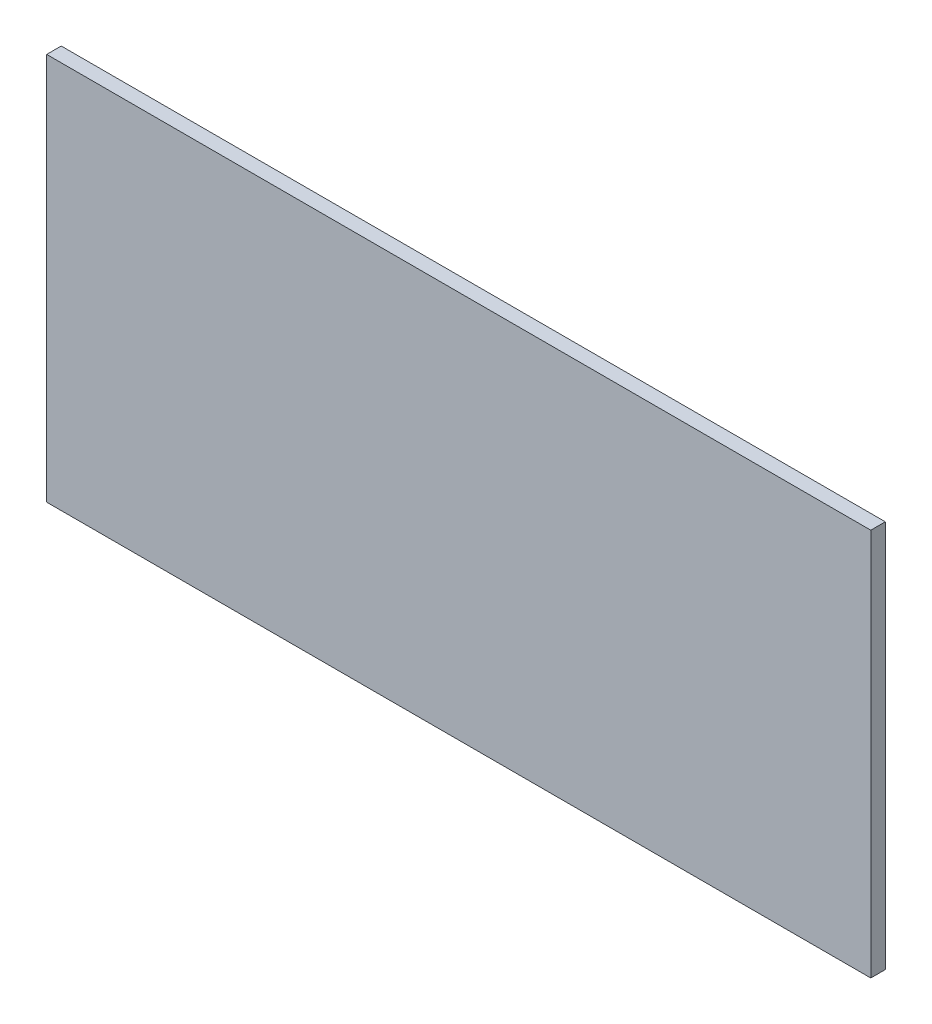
ISO-10303-21;
HEADER;
FILE_DESCRIPTION(('STEP AP214'),'2;1');
FILE_NAME('part.step','',(''),(''),'','','');
FILE_SCHEMA(('AUTOMOTIVE_DESIGN { 1 0 10303 214 1 1 1 1 }'));
ENDSEC;
DATA;
#1=APPLICATION_CONTEXT('core data for automotive mechanical design processes');
#2=APPLICATION_PROTOCOL_DEFINITION('international standard','automotive_design',2000,#1);
#3=PRODUCT_CONTEXT('',#1,'mechanical');
#4=PRODUCT('Part','Part','',(#3));
#5=PRODUCT_RELATED_PRODUCT_CATEGORY('part','',(#4));
#6=PRODUCT_DEFINITION_FORMATION('','',#4);
#7=PRODUCT_DEFINITION_CONTEXT('part definition',#1,'design');
#8=PRODUCT_DEFINITION('design','',#6,#7);
#9=PRODUCT_DEFINITION_SHAPE('','',#8);
#10=(LENGTH_UNIT() NAMED_UNIT(*) SI_UNIT(.MILLI.,.METRE.));
#11=(NAMED_UNIT(*) PLANE_ANGLE_UNIT() SI_UNIT($,.RADIAN.));
#12=(NAMED_UNIT(*) SI_UNIT($,.STERADIAN.) SOLID_ANGLE_UNIT());
#13=UNCERTAINTY_MEASURE_WITH_UNIT(LENGTH_MEASURE(1.E-05),#10,'distance_accuracy_value','');
#14=(GEOMETRIC_REPRESENTATION_CONTEXT(3) GLOBAL_UNCERTAINTY_ASSIGNED_CONTEXT((#13)) GLOBAL_UNIT_ASSIGNED_CONTEXT((#10,
#11,#12)) REPRESENTATION_CONTEXT('',''));
#15=CARTESIAN_POINT('',(0.,0.,0.));
#16=DIRECTION('',(0.,0.,1.));
#17=DIRECTION('',(1.,0.,0.));
#18=AXIS2_PLACEMENT_3D('',#15,#16,#17);
#19=CARTESIAN_POINT('',(0.,0.,30.));
#20=DIRECTION('',(0.,0.,1.));
#21=DIRECTION('',(1.,0.,0.));
#22=AXIS2_PLACEMENT_3D('',#19,#20,#21);
#23=PLANE('',#22);
#24=DIRECTION('',(1.,0.,0.));
#25=VECTOR('',#24,1.);
#26=CARTESIAN_POINT('',(-850.,-400.,30.));
#27=LINE('',#26,#25);
#28=CARTESIAN_POINT('',(-850.,-400.,30.));
#29=VERTEX_POINT('',#28);
#30=CARTESIAN_POINT('',(850.,-400.,30.));
#31=VERTEX_POINT('',#30);
#32=EDGE_CURVE('E81',#29,#31,#27,.T.);
#33=ORIENTED_EDGE('',*,*,#32,.T.);
#34=DIRECTION('',(0.,1.,0.));
#35=VECTOR('',#34,1.);
#36=CARTESIAN_POINT('',(850.,-400.,30.));
#37=LINE('',#36,#35);
#38=CARTESIAN_POINT('',(850.,400.,30.));
#39=VERTEX_POINT('',#38);
#40=EDGE_CURVE('E102',#31,#39,#37,.T.);
#41=ORIENTED_EDGE('',*,*,#40,.T.);
#42=DIRECTION('',(-1.,0.,0.));
#43=VECTOR('',#42,1.);
#44=CARTESIAN_POINT('',(850.,400.,30.));
#45=LINE('',#44,#43);
#46=CARTESIAN_POINT('',(-850.,400.,30.));
#47=VERTEX_POINT('',#46);
#48=EDGE_CURVE('E74',#39,#47,#45,.T.);
#49=ORIENTED_EDGE('',*,*,#48,.T.);
#50=DIRECTION('',(0.,-1.,0.));
#51=VECTOR('',#50,1.);
#52=CARTESIAN_POINT('',(-850.,400.,30.));
#53=LINE('',#52,#51);
#54=EDGE_CURVE('E10',#47,#29,#53,.T.);
#55=ORIENTED_EDGE('',*,*,#54,.T.);
#56=EDGE_LOOP('',(#33,#41,#49,#55));
#57=FACE_BOUND('',#56,.T.);
#58=ADVANCED_FACE('F16',(#57),#23,.T.);
#59=CARTESIAN_POINT('',(0.,0.,0.));
#60=DIRECTION('',(0.,0.,1.));
#61=DIRECTION('',(1.,0.,0.));
#62=AXIS2_PLACEMENT_3D('',#59,#60,#61);
#63=PLANE('',#62);
#64=DIRECTION('',(0.,-1.,0.));
#65=VECTOR('',#64,1.);
#66=CARTESIAN_POINT('',(-850.,400.,0.));
#67=LINE('',#66,#65);
#68=CARTESIAN_POINT('',(-850.,400.,0.));
#69=VERTEX_POINT('',#68);
#70=CARTESIAN_POINT('',(-850.,-400.,0.));
#71=VERTEX_POINT('',#70);
#72=EDGE_CURVE('E25',#69,#71,#67,.T.);
#73=ORIENTED_EDGE('',*,*,#72,.F.);
#74=DIRECTION('',(-1.,0.,0.));
#75=VECTOR('',#74,1.);
#76=CARTESIAN_POINT('',(850.,400.,0.));
#77=LINE('',#76,#75);
#78=CARTESIAN_POINT('',(850.,400.,0.));
#79=VERTEX_POINT('',#78);
#80=EDGE_CURVE('E105',#79,#69,#77,.T.);
#81=ORIENTED_EDGE('',*,*,#80,.F.);
#82=DIRECTION('',(0.,1.,0.));
#83=VECTOR('',#82,1.);
#84=CARTESIAN_POINT('',(850.,-400.,0.));
#85=LINE('',#84,#83);
#86=CARTESIAN_POINT('',(850.,-400.,0.));
#87=VERTEX_POINT('',#86);
#88=EDGE_CURVE('E83',#87,#79,#85,.T.);
#89=ORIENTED_EDGE('',*,*,#88,.F.);
#90=DIRECTION('',(1.,0.,0.));
#91=VECTOR('',#90,1.);
#92=CARTESIAN_POINT('',(-850.,-400.,0.));
#93=LINE('',#92,#91);
#94=EDGE_CURVE('E79',#71,#87,#93,.T.);
#95=ORIENTED_EDGE('',*,*,#94,.F.);
#96=EDGE_LOOP('',(#73,#81,#89,#95));
#97=FACE_BOUND('',#96,.T.);
#98=ADVANCED_FACE('F18',(#97),#63,.F.);
#99=CARTESIAN_POINT('',(-850.,400.,0.));
#100=DIRECTION('',(1.,0.,0.));
#101=DIRECTION('',(0.,1.,0.));
#102=AXIS2_PLACEMENT_3D('',#99,#100,#101);
#103=PLANE('',#102);
#104=ORIENTED_EDGE('',*,*,#72,.T.);
#105=DIRECTION('',(0.,0.,1.));
#106=VECTOR('',#105,1.);
#107=CARTESIAN_POINT('',(-850.,-400.,0.));
#108=LINE('',#107,#106);
#109=EDGE_CURVE('E68',#71,#29,#108,.T.);
#110=ORIENTED_EDGE('',*,*,#109,.T.);
#111=ORIENTED_EDGE('',*,*,#54,.F.);
#112=DIRECTION('',(0.,0.,1.));
#113=VECTOR('',#112,1.);
#114=CARTESIAN_POINT('',(-850.,400.,0.));
#115=LINE('',#114,#113);
#116=EDGE_CURVE('E71',#69,#47,#115,.T.);
#117=ORIENTED_EDGE('',*,*,#116,.F.);
#118=EDGE_LOOP('',(#104,#110,#111,#117));
#119=FACE_BOUND('',#118,.T.);
#120=ADVANCED_FACE('F67',(#119),#103,.F.);
#121=CARTESIAN_POINT('',(850.,400.,0.));
#122=DIRECTION('',(0.,-1.,0.));
#123=DIRECTION('',(0.,0.,-1.));
#124=AXIS2_PLACEMENT_3D('',#121,#122,#123);
#125=PLANE('',#124);
#126=ORIENTED_EDGE('',*,*,#80,.T.);
#127=ORIENTED_EDGE('',*,*,#116,.T.);
#128=ORIENTED_EDGE('',*,*,#48,.F.);
#129=DIRECTION('',(0.,0.,1.));
#130=VECTOR('',#129,1.);
#131=CARTESIAN_POINT('',(850.,400.,0.));
#132=LINE('',#131,#130);
#133=EDGE_CURVE('E98',#79,#39,#132,.T.);
#134=ORIENTED_EDGE('',*,*,#133,.F.);
#135=EDGE_LOOP('',(#126,#127,#128,#134));
#136=FACE_BOUND('',#135,.T.);
#137=ADVANCED_FACE('F114',(#136),#125,.F.);
#138=CARTESIAN_POINT('',(850.,-400.,0.));
#139=DIRECTION('',(-1.,0.,0.));
#140=DIRECTION('',(0.,0.,1.));
#141=AXIS2_PLACEMENT_3D('',#138,#139,#140);
#142=PLANE('',#141);
#143=ORIENTED_EDGE('',*,*,#88,.T.);
#144=ORIENTED_EDGE('',*,*,#133,.T.);
#145=ORIENTED_EDGE('',*,*,#40,.F.);
#146=DIRECTION('',(0.,0.,1.));
#147=VECTOR('',#146,1.);
#148=CARTESIAN_POINT('',(850.,-400.,0.));
#149=LINE('',#148,#147);
#150=EDGE_CURVE('E88',#87,#31,#149,.T.);
#151=ORIENTED_EDGE('',*,*,#150,.F.);
#152=EDGE_LOOP('',(#143,#144,#145,#151));
#153=FACE_BOUND('',#152,.T.);
#154=ADVANCED_FACE('F117',(#153),#142,.F.);
#155=CARTESIAN_POINT('',(-850.,-400.,0.));
#156=DIRECTION('',(0.,1.,0.));
#157=DIRECTION('',(1.,0.,0.));
#158=AXIS2_PLACEMENT_3D('',#155,#156,#157);
#159=PLANE('',#158);
#160=ORIENTED_EDGE('',*,*,#94,.T.);
#161=ORIENTED_EDGE('',*,*,#150,.T.);
#162=ORIENTED_EDGE('',*,*,#32,.F.);
#163=ORIENTED_EDGE('',*,*,#109,.F.);
#164=EDGE_LOOP('',(#160,#161,#162,#163));
#165=FACE_BOUND('',#164,.T.);
#166=ADVANCED_FACE('F77',(#165),#159,.F.);
#167=CLOSED_SHELL('',(#58,#98,#120,#137,#154,#166));
#168=MANIFOLD_SOLID_BREP('B1',#167);
#169=ADVANCED_BREP_SHAPE_REPRESENTATION('',(#18,#168),#14);
#170=SHAPE_DEFINITION_REPRESENTATION(#9,#169);
ENDSEC;
END-ISO-10303-21;
